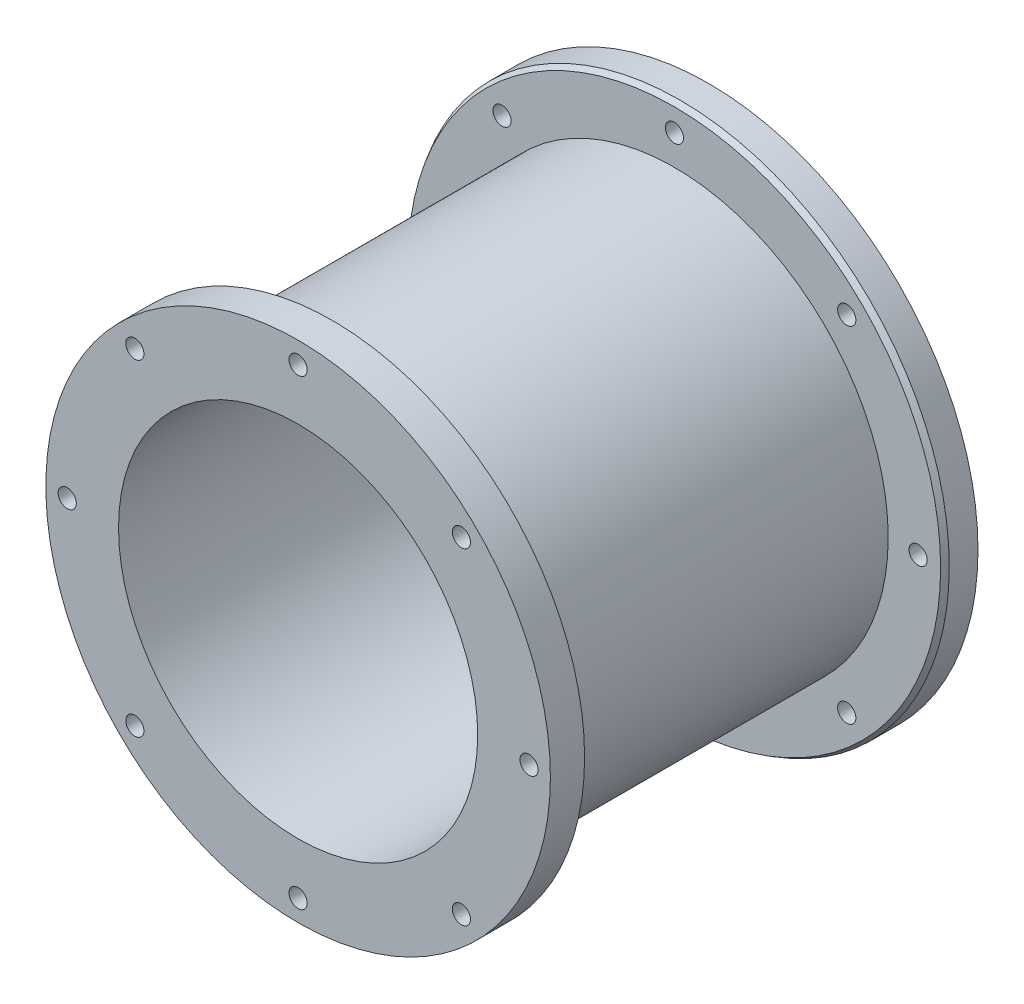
ISO-10303-21;
HEADER;
FILE_DESCRIPTION(('STEP AP214'),'2;1');
FILE_NAME('part.step','',(''),(''),'','','');
FILE_SCHEMA(('AUTOMOTIVE_DESIGN { 1 0 10303 214 1 1 1 1 }'));
ENDSEC;
DATA;
#1=APPLICATION_CONTEXT('core data for automotive mechanical design processes');
#2=APPLICATION_PROTOCOL_DEFINITION('international standard','automotive_design',2000,#1);
#3=PRODUCT_CONTEXT('',#1,'mechanical');
#4=PRODUCT('Part','Part','',(#3));
#5=PRODUCT_RELATED_PRODUCT_CATEGORY('part','',(#4));
#6=PRODUCT_DEFINITION_FORMATION('','',#4);
#7=PRODUCT_DEFINITION_CONTEXT('part definition',#1,'design');
#8=PRODUCT_DEFINITION('design','',#6,#7);
#9=PRODUCT_DEFINITION_SHAPE('','',#8);
#10=(LENGTH_UNIT() NAMED_UNIT(*) SI_UNIT(.MILLI.,.METRE.));
#11=(NAMED_UNIT(*) PLANE_ANGLE_UNIT() SI_UNIT($,.RADIAN.));
#12=(NAMED_UNIT(*) SI_UNIT($,.STERADIAN.) SOLID_ANGLE_UNIT());
#13=UNCERTAINTY_MEASURE_WITH_UNIT(LENGTH_MEASURE(1.E-05),#10,'distance_accuracy_value','');
#14=(GEOMETRIC_REPRESENTATION_CONTEXT(3) GLOBAL_UNCERTAINTY_ASSIGNED_CONTEXT((#13)) GLOBAL_UNIT_ASSIGNED_CONTEXT((#10,
#11,#12)) REPRESENTATION_CONTEXT('',''));
#15=CARTESIAN_POINT('',(0.,0.,0.));
#16=DIRECTION('',(0.,0.,1.));
#17=DIRECTION('',(1.,0.,0.));
#18=AXIS2_PLACEMENT_3D('',#15,#16,#17);
#19=CARTESIAN_POINT('',(0.,0.,0.));
#20=DIRECTION('',(0.,0.,1.));
#21=DIRECTION('',(1.,0.,0.));
#22=AXIS2_PLACEMENT_3D('',#19,#20,#21);
#23=PLANE('',#22);
#24=CARTESIAN_POINT('',(0.,0.,0.));
#25=DIRECTION('',(0.,0.,1.));
#26=DIRECTION('',(1.,0.,0.));
#27=AXIS2_PLACEMENT_3D('',#24,#25,#26);
#28=CIRCLE('',#27,74.2136250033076);
#29=CARTESIAN_POINT('',(74.2136250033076,0.,0.));
#30=VERTEX_POINT('',#29);
#31=EDGE_CURVE('E163',#30,#30,#28,.T.);
#32=ORIENTED_EDGE('',*,*,#31,.F.);
#33=EDGE_LOOP('',(#32));
#34=FACE_BOUND('',#33,.T.);
#35=CARTESIAN_POINT('',(0.,0.,0.));
#36=DIRECTION('',(0.,0.,1.));
#37=DIRECTION('',(1.,0.,0.));
#38=AXIS2_PLACEMENT_3D('',#35,#36,#37);
#39=CIRCLE('',#38,66.675);
#40=CARTESIAN_POINT('',(66.675,0.,0.));
#41=VERTEX_POINT('',#40);
#42=EDGE_CURVE('E44',#41,#41,#39,.T.);
#43=ORIENTED_EDGE('',*,*,#42,.T.);
#44=EDGE_LOOP('',(#43));
#45=FACE_BOUND('',#44,.T.);
#46=ADVANCED_FACE('F29',(#34,#45),#23,.F.);
#47=CARTESIAN_POINT('',(0.,0.,12.7));
#48=DIRECTION('',(0.,0.,1.));
#49=DIRECTION('',(1.,0.,0.));
#50=AXIS2_PLACEMENT_3D('',#47,#48,#49);
#51=PLANE('',#50);
#52=CARTESIAN_POINT('',(0.,0.,12.7));
#53=DIRECTION('',(0.,0.,1.));
#54=DIRECTION('',(1.,0.,0.));
#55=AXIS2_PLACEMENT_3D('',#52,#53,#54);
#56=CIRCLE('',#55,98.8393242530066);
#57=CARTESIAN_POINT('',(98.8393242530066,0.,12.7));
#58=VERTEX_POINT('',#57);
#59=EDGE_CURVE('E36',#58,#58,#56,.T.);
#60=ORIENTED_EDGE('',*,*,#59,.T.);
#61=EDGE_LOOP('',(#60));
#62=FACE_BOUND('',#61,.T.);
#63=CARTESIAN_POINT('',(-63.9843248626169,63.9843248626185,12.7));
#64=DIRECTION('',(0.,0.,1.));
#65=DIRECTION('',(1.,0.,0.));
#66=AXIS2_PLACEMENT_3D('',#63,#64,#65);
#67=CIRCLE('',#66,3.37819999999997);
#68=CARTESIAN_POINT('',(-60.606124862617,63.9843248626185,12.7));
#69=VERTEX_POINT('',#68);
#70=EDGE_CURVE('E80',#69,#69,#67,.T.);
#71=ORIENTED_EDGE('',*,*,#70,.F.);
#72=EDGE_LOOP('',(#71));
#73=FACE_BOUND('',#72,.T.);
#74=CARTESIAN_POINT('',(-90.4875,9.47806801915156E-13,12.7));
#75=DIRECTION('',(0.,0.,1.));
#76=DIRECTION('',(1.,0.,0.));
#77=AXIS2_PLACEMENT_3D('',#74,#75,#76);
#78=CIRCLE('',#77,3.37819999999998);
#79=CARTESIAN_POINT('',(-87.1093,9.47806801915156E-13,12.7));
#80=VERTEX_POINT('',#79);
#81=EDGE_CURVE('E85',#80,#80,#78,.T.);
#82=ORIENTED_EDGE('',*,*,#81,.F.);
#83=EDGE_LOOP('',(#82));
#84=FACE_BOUND('',#83,.T.);
#85=CARTESIAN_POINT('',(-63.9843248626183,-63.9843248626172,12.7));
#86=DIRECTION('',(0.,0.,1.));
#87=DIRECTION('',(1.,0.,0.));
#88=AXIS2_PLACEMENT_3D('',#85,#86,#87);
#89=CIRCLE('',#88,3.37819999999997);
#90=CARTESIAN_POINT('',(-60.6061248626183,-63.9843248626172,12.7));
#91=VERTEX_POINT('',#90);
#92=EDGE_CURVE('E89',#91,#91,#89,.T.);
#93=ORIENTED_EDGE('',*,*,#92,.F.);
#94=EDGE_LOOP('',(#93));
#95=FACE_BOUND('',#94,.T.);
#96=CARTESIAN_POINT('',(-6.3187120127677E-13,-90.4875,12.7));
#97=DIRECTION('',(0.,0.,1.));
#98=DIRECTION('',(1.,0.,0.));
#99=AXIS2_PLACEMENT_3D('',#96,#97,#98);
#100=CIRCLE('',#99,3.37819999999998);
#101=CARTESIAN_POINT('',(3.37819999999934,-90.4875,12.7));
#102=VERTEX_POINT('',#101);
#103=EDGE_CURVE('E93',#102,#102,#100,.T.);
#104=ORIENTED_EDGE('',*,*,#103,.F.);
#105=EDGE_LOOP('',(#104));
#106=FACE_BOUND('',#105,.T.);
#107=CARTESIAN_POINT('',(63.9843248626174,-63.9843248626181,12.7));
#108=DIRECTION('',(0.,0.,1.));
#109=DIRECTION('',(1.,0.,0.));
#110=AXIS2_PLACEMENT_3D('',#107,#108,#109);
#111=CIRCLE('',#110,3.37819999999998);
#112=CARTESIAN_POINT('',(67.3625248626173,-63.9843248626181,12.7));
#113=VERTEX_POINT('',#112);
#114=EDGE_CURVE('E97',#113,#113,#111,.T.);
#115=ORIENTED_EDGE('',*,*,#114,.F.);
#116=EDGE_LOOP('',(#115));
#117=FACE_BOUND('',#116,.T.);
#118=CARTESIAN_POINT('',(90.4875,-3.15935600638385E-13,12.7));
#119=DIRECTION('',(0.,0.,1.));
#120=DIRECTION('',(1.,0.,0.));
#121=AXIS2_PLACEMENT_3D('',#118,#119,#120);
#122=CIRCLE('',#121,3.37819999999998);
#123=CARTESIAN_POINT('',(93.8657,-3.15935600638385E-13,12.7));
#124=VERTEX_POINT('',#123);
#125=EDGE_CURVE('E101',#124,#124,#122,.T.);
#126=ORIENTED_EDGE('',*,*,#125,.F.);
#127=EDGE_LOOP('',(#126));
#128=FACE_BOUND('',#127,.T.);
#129=CARTESIAN_POINT('',(63.9843248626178,63.9843248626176,12.7));
#130=DIRECTION('',(0.,0.,1.));
#131=DIRECTION('',(1.,0.,0.));
#132=AXIS2_PLACEMENT_3D('',#129,#130,#131);
#133=CIRCLE('',#132,3.37819999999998);
#134=CARTESIAN_POINT('',(67.3625248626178,63.9843248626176,12.7));
#135=VERTEX_POINT('',#134);
#136=EDGE_CURVE('E105',#135,#135,#133,.T.);
#137=ORIENTED_EDGE('',*,*,#136,.F.);
#138=EDGE_LOOP('',(#137));
#139=FACE_BOUND('',#138,.T.);
#140=CARTESIAN_POINT('',(0.,90.4875,12.7));
#141=DIRECTION('',(0.,0.,1.));
#142=DIRECTION('',(1.,0.,0.));
#143=AXIS2_PLACEMENT_3D('',#140,#141,#142);
#144=CIRCLE('',#143,3.37819999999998);
#145=CARTESIAN_POINT('',(3.37819999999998,90.4875,12.7));
#146=VERTEX_POINT('',#145);
#147=EDGE_CURVE('E109',#146,#146,#144,.T.);
#148=ORIENTED_EDGE('',*,*,#147,.F.);
#149=EDGE_LOOP('',(#148));
#150=FACE_BOUND('',#149,.T.);
#151=CARTESIAN_POINT('',(0.,0.,12.7));
#152=DIRECTION('',(0.,0.,1.));
#153=DIRECTION('',(1.,0.,0.));
#154=AXIS2_PLACEMENT_3D('',#151,#152,#153);
#155=CIRCLE('',#154,79.375);
#156=CARTESIAN_POINT('',(79.375,0.,12.7));
#157=VERTEX_POINT('',#156);
#158=EDGE_CURVE('E111',#157,#157,#155,.T.);
#159=ORIENTED_EDGE('',*,*,#158,.F.);
#160=EDGE_LOOP('',(#159));
#161=FACE_BOUND('',#160,.T.);
#162=ADVANCED_FACE('F197',(#62,#73,#84,#95,#106,#117,#128,#139,#150,#161),#51,.T.);
#163=CARTESIAN_POINT('',(0.,0.,0.));
#164=DIRECTION('',(0.,0.,1.));
#165=DIRECTION('',(1.,0.,0.));
#166=AXIS2_PLACEMENT_3D('',#163,#164,#165);
#167=CIRCLE('',#166,79.2276420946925);
#168=CARTESIAN_POINT('',(79.2276420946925,0.,0.));
#169=VERTEX_POINT('',#168);
#170=EDGE_CURVE('E166',#169,#169,#167,.T.);
#171=ORIENTED_EDGE('',*,*,#170,.T.);
#172=EDGE_LOOP('',(#171));
#173=FACE_BOUND('',#172,.T.);
#174=CARTESIAN_POINT('',(-63.9843248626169,63.9843248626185,0.));
#175=DIRECTION('',(0.,0.,-1.));
#176=DIRECTION('',(-1.,0.,0.));
#177=AXIS2_PLACEMENT_3D('',#174,#175,#176);
#178=CIRCLE('',#177,3.37819999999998);
#179=CARTESIAN_POINT('',(-67.3625248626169,63.9843248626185,0.));
#180=VERTEX_POINT('',#179);
#181=EDGE_CURVE('E84',#180,#180,#178,.T.);
#182=ORIENTED_EDGE('',*,*,#181,.F.);
#183=EDGE_LOOP('',(#182));
#184=FACE_BOUND('',#183,.T.);
#185=CARTESIAN_POINT('',(-90.4875,9.47806801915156E-13,0.));
#186=DIRECTION('',(0.,0.,-1.));
#187=DIRECTION('',(-1.,0.,0.));
#188=AXIS2_PLACEMENT_3D('',#185,#186,#187);
#189=CIRCLE('',#188,3.37819999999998);
#190=CARTESIAN_POINT('',(-93.8657,9.47806801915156E-13,0.));
#191=VERTEX_POINT('',#190);
#192=EDGE_CURVE('E83',#191,#191,#189,.T.);
#193=ORIENTED_EDGE('',*,*,#192,.F.);
#194=EDGE_LOOP('',(#193));
#195=FACE_BOUND('',#194,.T.);
#196=CARTESIAN_POINT('',(-63.9843248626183,-63.9843248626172,0.));
#197=DIRECTION('',(0.,0.,-1.));
#198=DIRECTION('',(-1.,0.,0.));
#199=AXIS2_PLACEMENT_3D('',#196,#197,#198);
#200=CIRCLE('',#199,3.37819999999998);
#201=CARTESIAN_POINT('',(-67.3625248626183,-63.9843248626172,0.));
#202=VERTEX_POINT('',#201);
#203=EDGE_CURVE('E88',#202,#202,#200,.T.);
#204=ORIENTED_EDGE('',*,*,#203,.F.);
#205=EDGE_LOOP('',(#204));
#206=FACE_BOUND('',#205,.T.);
#207=CARTESIAN_POINT('',(-6.3187120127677E-13,-90.4875,0.));
#208=DIRECTION('',(0.,0.,-1.));
#209=DIRECTION('',(-1.,0.,0.));
#210=AXIS2_PLACEMENT_3D('',#207,#208,#209);
#211=CIRCLE('',#210,3.37819999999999);
#212=CARTESIAN_POINT('',(-3.37820000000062,-90.4875,0.));
#213=VERTEX_POINT('',#212);
#214=EDGE_CURVE('E92',#213,#213,#211,.T.);
#215=ORIENTED_EDGE('',*,*,#214,.F.);
#216=EDGE_LOOP('',(#215));
#217=FACE_BOUND('',#216,.T.);
#218=CARTESIAN_POINT('',(63.9843248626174,-63.9843248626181,0.));
#219=DIRECTION('',(0.,0.,-1.));
#220=DIRECTION('',(-1.,0.,0.));
#221=AXIS2_PLACEMENT_3D('',#218,#219,#220);
#222=CIRCLE('',#221,3.37819999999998);
#223=CARTESIAN_POINT('',(60.6061248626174,-63.9843248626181,0.));
#224=VERTEX_POINT('',#223);
#225=EDGE_CURVE('E96',#224,#224,#222,.T.);
#226=ORIENTED_EDGE('',*,*,#225,.F.);
#227=EDGE_LOOP('',(#226));
#228=FACE_BOUND('',#227,.T.);
#229=CARTESIAN_POINT('',(90.4875,-3.15935600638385E-13,0.));
#230=DIRECTION('',(0.,0.,-1.));
#231=DIRECTION('',(-1.,0.,0.));
#232=AXIS2_PLACEMENT_3D('',#229,#230,#231);
#233=CIRCLE('',#232,3.37819999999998);
#234=CARTESIAN_POINT('',(87.1093,-3.15935600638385E-13,0.));
#235=VERTEX_POINT('',#234);
#236=EDGE_CURVE('E100',#235,#235,#233,.T.);
#237=ORIENTED_EDGE('',*,*,#236,.F.);
#238=EDGE_LOOP('',(#237));
#239=FACE_BOUND('',#238,.T.);
#240=CARTESIAN_POINT('',(63.9843248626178,63.9843248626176,0.));
#241=DIRECTION('',(0.,0.,-1.));
#242=DIRECTION('',(-1.,0.,0.));
#243=AXIS2_PLACEMENT_3D('',#240,#241,#242);
#244=CIRCLE('',#243,3.37819999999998);
#245=CARTESIAN_POINT('',(60.6061248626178,63.9843248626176,0.));
#246=VERTEX_POINT('',#245);
#247=EDGE_CURVE('E104',#246,#246,#244,.T.);
#248=ORIENTED_EDGE('',*,*,#247,.F.);
#249=EDGE_LOOP('',(#248));
#250=FACE_BOUND('',#249,.T.);
#251=CARTESIAN_POINT('',(0.,90.4875,0.));
#252=DIRECTION('',(0.,0.,-1.));
#253=DIRECTION('',(-1.,0.,0.));
#254=AXIS2_PLACEMENT_3D('',#251,#252,#253);
#255=CIRCLE('',#254,3.37819999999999);
#256=CARTESIAN_POINT('',(-3.37819999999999,90.4875,0.));
#257=VERTEX_POINT('',#256);
#258=EDGE_CURVE('E108',#257,#257,#255,.T.);
#259=ORIENTED_EDGE('',*,*,#258,.F.);
#260=EDGE_LOOP('',(#259));
#261=FACE_BOUND('',#260,.T.);
#262=CARTESIAN_POINT('',(0.,0.,0.));
#263=DIRECTION('',(0.,0.,1.));
#264=DIRECTION('',(1.,0.,0.));
#265=AXIS2_PLACEMENT_3D('',#262,#263,#264);
#266=CIRCLE('',#265,100.0125);
#267=CARTESIAN_POINT('',(100.0125,0.,0.));
#268=VERTEX_POINT('',#267);
#269=EDGE_CURVE('E40',#268,#268,#266,.T.);
#270=ORIENTED_EDGE('',*,*,#269,.F.);
#271=EDGE_LOOP('',(#270));
#272=FACE_BOUND('',#271,.T.);
#273=ADVANCED_FACE('F199',(#173,#184,#195,#206,#217,#228,#239,#250,#261,#272),#23,.F.);
#274=CARTESIAN_POINT('',(0.,0.,12.7));
#275=DIRECTION('',(0.,0.,-1.));
#276=DIRECTION('',(-1.,0.,0.));
#277=AXIS2_PLACEMENT_3D('',#274,#275,#276);
#278=CYLINDRICAL_SURFACE('',#277,100.0125);
#279=CARTESIAN_POINT('',(0.,0.,10.668));
#280=DIRECTION('',(0.,0.,1.));
#281=DIRECTION('',(1.,0.,0.));
#282=AXIS2_PLACEMENT_3D('',#279,#280,#281);
#283=CIRCLE('',#282,100.0125);
#284=CARTESIAN_POINT('',(100.0125,0.,10.668));
#285=VERTEX_POINT('',#284);
#286=EDGE_CURVE('E10',#285,#285,#283,.F.);
#287=ORIENTED_EDGE('',*,*,#286,.T.);
#288=EDGE_LOOP('',(#287));
#289=FACE_BOUND('',#288,.T.);
#290=ORIENTED_EDGE('',*,*,#269,.T.);
#291=EDGE_LOOP('',(#290));
#292=FACE_BOUND('',#291,.T.);
#293=ADVANCED_FACE('F31',(#289,#292),#278,.T.);
#294=CARTESIAN_POINT('',(0.,0.,12.7));
#295=DIRECTION('',(0.,0.,-1.));
#296=DIRECTION('',(-1.,0.,0.));
#297=AXIS2_PLACEMENT_3D('',#294,#295,#296);
#298=CYLINDRICAL_SURFACE('',#297,66.675);
#299=ORIENTED_EDGE('',*,*,#42,.F.);
#300=EDGE_LOOP('',(#299));
#301=FACE_BOUND('',#300,.T.);
#302=CARTESIAN_POINT('',(0.,0.,152.4));
#303=DIRECTION('',(0.,0.,1.));
#304=DIRECTION('',(1.,0.,0.));
#305=AXIS2_PLACEMENT_3D('',#302,#303,#304);
#306=CIRCLE('',#305,66.675);
#307=CARTESIAN_POINT('',(66.675,0.,152.4));
#308=VERTEX_POINT('',#307);
#309=EDGE_CURVE('E79',#308,#308,#306,.T.);
#310=ORIENTED_EDGE('',*,*,#309,.T.);
#311=EDGE_LOOP('',(#310));
#312=FACE_BOUND('',#311,.T.);
#313=ADVANCED_FACE('F202',(#301,#312),#298,.F.);
#314=CARTESIAN_POINT('',(0.,0.,139.7));
#315=DIRECTION('',(0.,0.,-1.));
#316=DIRECTION('',(-1.,0.,0.));
#317=AXIS2_PLACEMENT_3D('',#314,#315,#316);
#318=CYLINDRICAL_SURFACE('',#317,79.375);
#319=CARTESIAN_POINT('',(0.,0.,139.7));
#320=DIRECTION('',(0.,0.,1.));
#321=DIRECTION('',(1.,0.,0.));
#322=AXIS2_PLACEMENT_3D('',#319,#320,#321);
#323=CIRCLE('',#322,79.375);
#324=CARTESIAN_POINT('',(79.375,0.,139.7));
#325=VERTEX_POINT('',#324);
#326=EDGE_CURVE('E115',#325,#325,#323,.T.);
#327=ORIENTED_EDGE('',*,*,#326,.F.);
#328=EDGE_LOOP('',(#327));
#329=FACE_BOUND('',#328,.T.);
#330=ORIENTED_EDGE('',*,*,#158,.T.);
#331=EDGE_LOOP('',(#330));
#332=FACE_BOUND('',#331,.T.);
#333=ADVANCED_FACE('F205',(#329,#332),#318,.T.);
#334=CARTESIAN_POINT('',(0.,90.4875,0.));
#335=DIRECTION('',(0.,0.,-1.));
#336=DIRECTION('',(-1.,0.,0.));
#337=AXIS2_PLACEMENT_3D('',#334,#335,#336);
#338=CYLINDRICAL_SURFACE('',#337,3.37819999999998);
#339=ORIENTED_EDGE('',*,*,#147,.T.);
#340=EDGE_LOOP('',(#339));
#341=FACE_BOUND('',#340,.T.);
#342=ORIENTED_EDGE('',*,*,#258,.T.);
#343=EDGE_LOOP('',(#342));
#344=FACE_BOUND('',#343,.T.);
#345=ADVANCED_FACE('F255',(#341,#344),#338,.F.);
#346=CARTESIAN_POINT('',(63.9843248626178,63.9843248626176,0.));
#347=DIRECTION('',(0.,0.,-1.));
#348=DIRECTION('',(-1.,0.,0.));
#349=AXIS2_PLACEMENT_3D('',#346,#347,#348);
#350=CYLINDRICAL_SURFACE('',#349,3.37819999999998);
#351=ORIENTED_EDGE('',*,*,#136,.T.);
#352=EDGE_LOOP('',(#351));
#353=FACE_BOUND('',#352,.T.);
#354=ORIENTED_EDGE('',*,*,#247,.T.);
#355=EDGE_LOOP('',(#354));
#356=FACE_BOUND('',#355,.T.);
#357=ADVANCED_FACE('F251',(#353,#356),#350,.F.);
#358=CARTESIAN_POINT('',(90.4875,-3.15935600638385E-13,0.));
#359=DIRECTION('',(0.,0.,-1.));
#360=DIRECTION('',(-1.,0.,0.));
#361=AXIS2_PLACEMENT_3D('',#358,#359,#360);
#362=CYLINDRICAL_SURFACE('',#361,3.37819999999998);
#363=ORIENTED_EDGE('',*,*,#125,.T.);
#364=EDGE_LOOP('',(#363));
#365=FACE_BOUND('',#364,.T.);
#366=ORIENTED_EDGE('',*,*,#236,.T.);
#367=EDGE_LOOP('',(#366));
#368=FACE_BOUND('',#367,.T.);
#369=ADVANCED_FACE('F247',(#365,#368),#362,.F.);
#370=CARTESIAN_POINT('',(63.9843248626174,-63.9843248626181,0.));
#371=DIRECTION('',(0.,0.,-1.));
#372=DIRECTION('',(-1.,0.,0.));
#373=AXIS2_PLACEMENT_3D('',#370,#371,#372);
#374=CYLINDRICAL_SURFACE('',#373,3.37819999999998);
#375=ORIENTED_EDGE('',*,*,#114,.T.);
#376=EDGE_LOOP('',(#375));
#377=FACE_BOUND('',#376,.T.);
#378=ORIENTED_EDGE('',*,*,#225,.T.);
#379=EDGE_LOOP('',(#378));
#380=FACE_BOUND('',#379,.T.);
#381=ADVANCED_FACE('F243',(#377,#380),#374,.F.);
#382=CARTESIAN_POINT('',(-6.3187120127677E-13,-90.4875,0.));
#383=DIRECTION('',(0.,0.,-1.));
#384=DIRECTION('',(-1.,0.,0.));
#385=AXIS2_PLACEMENT_3D('',#382,#383,#384);
#386=CYLINDRICAL_SURFACE('',#385,3.37819999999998);
#387=ORIENTED_EDGE('',*,*,#103,.T.);
#388=EDGE_LOOP('',(#387));
#389=FACE_BOUND('',#388,.T.);
#390=ORIENTED_EDGE('',*,*,#214,.T.);
#391=EDGE_LOOP('',(#390));
#392=FACE_BOUND('',#391,.T.);
#393=ADVANCED_FACE('F239',(#389,#392),#386,.F.);
#394=CARTESIAN_POINT('',(-63.9843248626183,-63.9843248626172,0.));
#395=DIRECTION('',(0.,0.,-1.));
#396=DIRECTION('',(-1.,0.,0.));
#397=AXIS2_PLACEMENT_3D('',#394,#395,#396);
#398=CYLINDRICAL_SURFACE('',#397,3.37819999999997);
#399=ORIENTED_EDGE('',*,*,#92,.T.);
#400=EDGE_LOOP('',(#399));
#401=FACE_BOUND('',#400,.T.);
#402=ORIENTED_EDGE('',*,*,#203,.T.);
#403=EDGE_LOOP('',(#402));
#404=FACE_BOUND('',#403,.T.);
#405=ADVANCED_FACE('F235',(#401,#404),#398,.F.);
#406=CARTESIAN_POINT('',(-90.4875,9.47806801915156E-13,0.));
#407=DIRECTION('',(0.,0.,-1.));
#408=DIRECTION('',(-1.,0.,0.));
#409=AXIS2_PLACEMENT_3D('',#406,#407,#408);
#410=CYLINDRICAL_SURFACE('',#409,3.37819999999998);
#411=ORIENTED_EDGE('',*,*,#81,.T.);
#412=EDGE_LOOP('',(#411));
#413=FACE_BOUND('',#412,.T.);
#414=ORIENTED_EDGE('',*,*,#192,.T.);
#415=EDGE_LOOP('',(#414));
#416=FACE_BOUND('',#415,.T.);
#417=ADVANCED_FACE('F231',(#413,#416),#410,.F.);
#418=CARTESIAN_POINT('',(-63.9843248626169,63.9843248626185,0.));
#419=DIRECTION('',(0.,0.,-1.));
#420=DIRECTION('',(-1.,0.,0.));
#421=AXIS2_PLACEMENT_3D('',#418,#419,#420);
#422=CYLINDRICAL_SURFACE('',#421,3.37819999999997);
#423=ORIENTED_EDGE('',*,*,#70,.T.);
#424=EDGE_LOOP('',(#423));
#425=FACE_BOUND('',#424,.T.);
#426=ORIENTED_EDGE('',*,*,#181,.T.);
#427=EDGE_LOOP('',(#426));
#428=FACE_BOUND('',#427,.T.);
#429=ADVANCED_FACE('F222',(#425,#428),#422,.F.);
#430=CARTESIAN_POINT('',(0.,0.,139.7));
#431=DIRECTION('',(0.,0.,1.));
#432=DIRECTION('',(1.,0.,0.));
#433=AXIS2_PLACEMENT_3D('',#430,#431,#432);
#434=PLANE('',#433);
#435=CARTESIAN_POINT('',(-60.616728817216,60.6167288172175,139.7));
#436=DIRECTION('',(0.,0.,1.));
#437=DIRECTION('',(1.,0.,0.));
#438=AXIS2_PLACEMENT_3D('',#435,#436,#437);
#439=CIRCLE('',#438,3.37819999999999);
#440=CARTESIAN_POINT('',(-57.2385288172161,60.6167288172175,139.7));
#441=VERTEX_POINT('',#440);
#442=EDGE_CURVE('E47',#441,#441,#439,.T.);
#443=ORIENTED_EDGE('',*,*,#442,.T.);
#444=EDGE_LOOP('',(#443));
#445=FACE_BOUND('',#444,.T.);
#446=CARTESIAN_POINT('',(-85.725,8.97922233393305E-13,139.7));
#447=DIRECTION('',(0.,0.,1.));
#448=DIRECTION('',(1.,0.,0.));
#449=AXIS2_PLACEMENT_3D('',#446,#447,#448);
#450=CIRCLE('',#449,3.37819999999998);
#451=CARTESIAN_POINT('',(-82.3468,8.97922233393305E-13,139.7));
#452=VERTEX_POINT('',#451);
#453=EDGE_CURVE('E52',#452,#452,#450,.T.);
#454=ORIENTED_EDGE('',*,*,#453,.T.);
#455=EDGE_LOOP('',(#454));
#456=FACE_BOUND('',#455,.T.);
#457=CARTESIAN_POINT('',(-60.6167288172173,-60.6167288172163,139.7));
#458=DIRECTION('',(0.,0.,1.));
#459=DIRECTION('',(1.,0.,0.));
#460=AXIS2_PLACEMENT_3D('',#457,#458,#459);
#461=CIRCLE('',#460,3.37819999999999);
#462=CARTESIAN_POINT('',(-57.2385288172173,-60.6167288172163,139.7));
#463=VERTEX_POINT('',#462);
#464=EDGE_CURVE('E56',#463,#463,#461,.T.);
#465=ORIENTED_EDGE('',*,*,#464,.T.);
#466=EDGE_LOOP('',(#465));
#467=FACE_BOUND('',#466,.T.);
#468=CARTESIAN_POINT('',(-5.98614822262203E-13,-85.725,139.7));
#469=DIRECTION('',(0.,0.,1.));
#470=DIRECTION('',(1.,0.,0.));
#471=AXIS2_PLACEMENT_3D('',#468,#469,#470);
#472=CIRCLE('',#471,3.37819999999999);
#473=CARTESIAN_POINT('',(3.37819999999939,-85.725,139.7));
#474=VERTEX_POINT('',#473);
#475=EDGE_CURVE('E60',#474,#474,#472,.T.);
#476=ORIENTED_EDGE('',*,*,#475,.T.);
#477=EDGE_LOOP('',(#476));
#478=FACE_BOUND('',#477,.T.);
#479=CARTESIAN_POINT('',(60.6167288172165,-60.6167288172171,139.7));
#480=DIRECTION('',(0.,0.,1.));
#481=DIRECTION('',(1.,0.,0.));
#482=AXIS2_PLACEMENT_3D('',#479,#480,#481);
#483=CIRCLE('',#482,3.37819999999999);
#484=CARTESIAN_POINT('',(63.9949288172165,-60.6167288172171,139.7));
#485=VERTEX_POINT('',#484);
#486=EDGE_CURVE('E64',#485,#485,#483,.T.);
#487=ORIENTED_EDGE('',*,*,#486,.T.);
#488=EDGE_LOOP('',(#487));
#489=FACE_BOUND('',#488,.T.);
#490=CARTESIAN_POINT('',(85.725,-2.99307411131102E-13,139.7));
#491=DIRECTION('',(0.,0.,1.));
#492=DIRECTION('',(1.,0.,0.));
#493=AXIS2_PLACEMENT_3D('',#490,#491,#492);
#494=CIRCLE('',#493,3.37819999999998);
#495=CARTESIAN_POINT('',(89.1032,-2.99307411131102E-13,139.7));
#496=VERTEX_POINT('',#495);
#497=EDGE_CURVE('E68',#496,#496,#494,.T.);
#498=ORIENTED_EDGE('',*,*,#497,.T.);
#499=EDGE_LOOP('',(#498));
#500=FACE_BOUND('',#499,.T.);
#501=CARTESIAN_POINT('',(60.6167288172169,60.6167288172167,139.7));
#502=DIRECTION('',(0.,0.,1.));
#503=DIRECTION('',(1.,0.,0.));
#504=AXIS2_PLACEMENT_3D('',#501,#502,#503);
#505=CIRCLE('',#504,3.37819999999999);
#506=CARTESIAN_POINT('',(63.9949288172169,60.6167288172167,139.7));
#507=VERTEX_POINT('',#506);
#508=EDGE_CURVE('E72',#507,#507,#505,.T.);
#509=ORIENTED_EDGE('',*,*,#508,.T.);
#510=EDGE_LOOP('',(#509));
#511=FACE_BOUND('',#510,.T.);
#512=CARTESIAN_POINT('',(0.,85.725,139.7));
#513=DIRECTION('',(0.,0.,1.));
#514=DIRECTION('',(1.,0.,0.));
#515=AXIS2_PLACEMENT_3D('',#512,#513,#514);
#516=CIRCLE('',#515,3.37819999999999);
#517=CARTESIAN_POINT('',(3.37819999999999,85.725,139.7));
#518=VERTEX_POINT('',#517);
#519=EDGE_CURVE('E76',#518,#518,#516,.T.);
#520=ORIENTED_EDGE('',*,*,#519,.T.);
#521=EDGE_LOOP('',(#520));
#522=FACE_BOUND('',#521,.T.);
#523=CARTESIAN_POINT('',(0.,0.,139.7));
#524=DIRECTION('',(0.,0.,1.));
#525=DIRECTION('',(1.,0.,0.));
#526=AXIS2_PLACEMENT_3D('',#523,#524,#525);
#527=CIRCLE('',#526,93.6625);
#528=CARTESIAN_POINT('',(93.6625,0.,139.7));
#529=VERTEX_POINT('',#528);
#530=EDGE_CURVE('E139',#529,#529,#527,.T.);
#531=ORIENTED_EDGE('',*,*,#530,.F.);
#532=EDGE_LOOP('',(#531));
#533=FACE_BOUND('',#532,.T.);
#534=ORIENTED_EDGE('',*,*,#326,.T.);
#535=EDGE_LOOP('',(#534));
#536=FACE_BOUND('',#535,.T.);
#537=ADVANCED_FACE('F212',(#445,#456,#467,#478,#489,#500,#511,#522,#533,#536),#434,.F.);
#538=CARTESIAN_POINT('',(0.,0.,152.4));
#539=DIRECTION('',(0.,0.,1.));
#540=DIRECTION('',(1.,0.,0.));
#541=AXIS2_PLACEMENT_3D('',#538,#539,#540);
#542=PLANE('',#541);
#543=CARTESIAN_POINT('',(-60.616728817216,60.6167288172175,152.4));
#544=DIRECTION('',(0.,0.,1.));
#545=DIRECTION('',(1.,0.,0.));
#546=AXIS2_PLACEMENT_3D('',#543,#544,#545);
#547=CIRCLE('',#546,3.37819999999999);
#548=CARTESIAN_POINT('',(-57.2385288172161,60.6167288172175,152.4));
#549=VERTEX_POINT('',#548);
#550=EDGE_CURVE('E51',#549,#549,#547,.T.);
#551=ORIENTED_EDGE('',*,*,#550,.F.);
#552=EDGE_LOOP('',(#551));
#553=FACE_BOUND('',#552,.T.);
#554=CARTESIAN_POINT('',(-85.725,8.97922233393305E-13,152.4));
#555=DIRECTION('',(0.,0.,1.));
#556=DIRECTION('',(1.,0.,0.));
#557=AXIS2_PLACEMENT_3D('',#554,#555,#556);
#558=CIRCLE('',#557,3.37819999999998);
#559=CARTESIAN_POINT('',(-82.3468,8.97922233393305E-13,152.4));
#560=VERTEX_POINT('',#559);
#561=EDGE_CURVE('E50',#560,#560,#558,.T.);
#562=ORIENTED_EDGE('',*,*,#561,.F.);
#563=EDGE_LOOP('',(#562));
#564=FACE_BOUND('',#563,.T.);
#565=CARTESIAN_POINT('',(-60.6167288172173,-60.6167288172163,152.4));
#566=DIRECTION('',(0.,0.,1.));
#567=DIRECTION('',(1.,0.,0.));
#568=AXIS2_PLACEMENT_3D('',#565,#566,#567);
#569=CIRCLE('',#568,3.37819999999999);
#570=CARTESIAN_POINT('',(-57.2385288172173,-60.6167288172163,152.4));
#571=VERTEX_POINT('',#570);
#572=EDGE_CURVE('E55',#571,#571,#569,.T.);
#573=ORIENTED_EDGE('',*,*,#572,.F.);
#574=EDGE_LOOP('',(#573));
#575=FACE_BOUND('',#574,.T.);
#576=CARTESIAN_POINT('',(-5.98614822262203E-13,-85.725,152.4));
#577=DIRECTION('',(0.,0.,1.));
#578=DIRECTION('',(1.,0.,0.));
#579=AXIS2_PLACEMENT_3D('',#576,#577,#578);
#580=CIRCLE('',#579,3.37819999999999);
#581=CARTESIAN_POINT('',(3.37819999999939,-85.725,152.4));
#582=VERTEX_POINT('',#581);
#583=EDGE_CURVE('E59',#582,#582,#580,.T.);
#584=ORIENTED_EDGE('',*,*,#583,.F.);
#585=EDGE_LOOP('',(#584));
#586=FACE_BOUND('',#585,.T.);
#587=CARTESIAN_POINT('',(60.6167288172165,-60.6167288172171,152.4));
#588=DIRECTION('',(0.,0.,1.));
#589=DIRECTION('',(1.,0.,0.));
#590=AXIS2_PLACEMENT_3D('',#587,#588,#589);
#591=CIRCLE('',#590,3.37819999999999);
#592=CARTESIAN_POINT('',(63.9949288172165,-60.6167288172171,152.4));
#593=VERTEX_POINT('',#592);
#594=EDGE_CURVE('E63',#593,#593,#591,.T.);
#595=ORIENTED_EDGE('',*,*,#594,.F.);
#596=EDGE_LOOP('',(#595));
#597=FACE_BOUND('',#596,.T.);
#598=CARTESIAN_POINT('',(85.725,-2.99307411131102E-13,152.4));
#599=DIRECTION('',(0.,0.,1.));
#600=DIRECTION('',(1.,0.,0.));
#601=AXIS2_PLACEMENT_3D('',#598,#599,#600);
#602=CIRCLE('',#601,3.37819999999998);
#603=CARTESIAN_POINT('',(89.1032,-2.99307411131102E-13,152.4));
#604=VERTEX_POINT('',#603);
#605=EDGE_CURVE('E67',#604,#604,#602,.T.);
#606=ORIENTED_EDGE('',*,*,#605,.F.);
#607=EDGE_LOOP('',(#606));
#608=FACE_BOUND('',#607,.T.);
#609=CARTESIAN_POINT('',(60.6167288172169,60.6167288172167,152.4));
#610=DIRECTION('',(0.,0.,1.));
#611=DIRECTION('',(1.,0.,0.));
#612=AXIS2_PLACEMENT_3D('',#609,#610,#611);
#613=CIRCLE('',#612,3.37819999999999);
#614=CARTESIAN_POINT('',(63.9949288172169,60.6167288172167,152.4));
#615=VERTEX_POINT('',#614);
#616=EDGE_CURVE('E71',#615,#615,#613,.T.);
#617=ORIENTED_EDGE('',*,*,#616,.F.);
#618=EDGE_LOOP('',(#617));
#619=FACE_BOUND('',#618,.T.);
#620=CARTESIAN_POINT('',(0.,85.725,152.4));
#621=DIRECTION('',(0.,0.,1.));
#622=DIRECTION('',(1.,0.,0.));
#623=AXIS2_PLACEMENT_3D('',#620,#621,#622);
#624=CIRCLE('',#623,3.37819999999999);
#625=CARTESIAN_POINT('',(3.37819999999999,85.725,152.4));
#626=VERTEX_POINT('',#625);
#627=EDGE_CURVE('E75',#626,#626,#624,.T.);
#628=ORIENTED_EDGE('',*,*,#627,.F.);
#629=EDGE_LOOP('',(#628));
#630=FACE_BOUND('',#629,.T.);
#631=CARTESIAN_POINT('',(0.,0.,152.4));
#632=DIRECTION('',(0.,0.,1.));
#633=DIRECTION('',(1.,0.,0.));
#634=AXIS2_PLACEMENT_3D('',#631,#632,#633);
#635=CIRCLE('',#634,93.6625);
#636=CARTESIAN_POINT('',(93.6625,0.,152.4));
#637=VERTEX_POINT('',#636);
#638=EDGE_CURVE('E136',#637,#637,#635,.T.);
#639=ORIENTED_EDGE('',*,*,#638,.T.);
#640=EDGE_LOOP('',(#639));
#641=FACE_BOUND('',#640,.T.);
#642=ORIENTED_EDGE('',*,*,#309,.F.);
#643=EDGE_LOOP('',(#642));
#644=FACE_BOUND('',#643,.T.);
#645=ADVANCED_FACE('F209',(#553,#564,#575,#586,#597,#608,#619,#630,#641,#644),#542,.T.);
#646=CARTESIAN_POINT('',(0.,0.,152.4));
#647=DIRECTION('',(0.,0.,-1.));
#648=DIRECTION('',(-1.,0.,0.));
#649=AXIS2_PLACEMENT_3D('',#646,#647,#648);
#650=CYLINDRICAL_SURFACE('',#649,93.6625);
#651=ORIENTED_EDGE('',*,*,#638,.F.);
#652=EDGE_LOOP('',(#651));
#653=FACE_BOUND('',#652,.T.);
#654=ORIENTED_EDGE('',*,*,#530,.T.);
#655=EDGE_LOOP('',(#654));
#656=FACE_BOUND('',#655,.T.);
#657=ADVANCED_FACE('F211',(#653,#656),#650,.T.);
#658=CARTESIAN_POINT('',(0.,85.725,152.4));
#659=DIRECTION('',(0.,0.,1.));
#660=DIRECTION('',(1.,0.,0.));
#661=AXIS2_PLACEMENT_3D('',#658,#659,#660);
#662=CYLINDRICAL_SURFACE('',#661,3.37819999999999);
#663=ORIENTED_EDGE('',*,*,#627,.T.);
#664=EDGE_LOOP('',(#663));
#665=FACE_BOUND('',#664,.T.);
#666=ORIENTED_EDGE('',*,*,#519,.F.);
#667=EDGE_LOOP('',(#666));
#668=FACE_BOUND('',#667,.T.);
#669=ADVANCED_FACE('F219',(#665,#668),#662,.F.);
#670=CARTESIAN_POINT('',(60.6167288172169,60.6167288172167,152.4));
#671=DIRECTION('',(0.,0.,1.));
#672=DIRECTION('',(1.,0.,0.));
#673=AXIS2_PLACEMENT_3D('',#670,#671,#672);
#674=CYLINDRICAL_SURFACE('',#673,3.37819999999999);
#675=ORIENTED_EDGE('',*,*,#616,.T.);
#676=EDGE_LOOP('',(#675));
#677=FACE_BOUND('',#676,.T.);
#678=ORIENTED_EDGE('',*,*,#508,.F.);
#679=EDGE_LOOP('',(#678));
#680=FACE_BOUND('',#679,.T.);
#681=ADVANCED_FACE('F360',(#677,#680),#674,.F.);
#682=CARTESIAN_POINT('',(85.725,-2.99307411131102E-13,152.4));
#683=DIRECTION('',(0.,0.,1.));
#684=DIRECTION('',(1.,0.,0.));
#685=AXIS2_PLACEMENT_3D('',#682,#683,#684);
#686=CYLINDRICAL_SURFACE('',#685,3.37819999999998);
#687=ORIENTED_EDGE('',*,*,#605,.T.);
#688=EDGE_LOOP('',(#687));
#689=FACE_BOUND('',#688,.T.);
#690=ORIENTED_EDGE('',*,*,#497,.F.);
#691=EDGE_LOOP('',(#690));
#692=FACE_BOUND('',#691,.T.);
#693=ADVANCED_FACE('F369',(#689,#692),#686,.F.);
#694=CARTESIAN_POINT('',(60.6167288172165,-60.6167288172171,152.4));
#695=DIRECTION('',(0.,0.,1.));
#696=DIRECTION('',(1.,0.,0.));
#697=AXIS2_PLACEMENT_3D('',#694,#695,#696);
#698=CYLINDRICAL_SURFACE('',#697,3.37819999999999);
#699=ORIENTED_EDGE('',*,*,#594,.T.);
#700=EDGE_LOOP('',(#699));
#701=FACE_BOUND('',#700,.T.);
#702=ORIENTED_EDGE('',*,*,#486,.F.);
#703=EDGE_LOOP('',(#702));
#704=FACE_BOUND('',#703,.T.);
#705=ADVANCED_FACE('F379',(#701,#704),#698,.F.);
#706=CARTESIAN_POINT('',(-5.98614822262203E-13,-85.725,152.4));
#707=DIRECTION('',(0.,0.,1.));
#708=DIRECTION('',(1.,0.,0.));
#709=AXIS2_PLACEMENT_3D('',#706,#707,#708);
#710=CYLINDRICAL_SURFACE('',#709,3.37819999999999);
#711=ORIENTED_EDGE('',*,*,#583,.T.);
#712=EDGE_LOOP('',(#711));
#713=FACE_BOUND('',#712,.T.);
#714=ORIENTED_EDGE('',*,*,#475,.F.);
#715=EDGE_LOOP('',(#714));
#716=FACE_BOUND('',#715,.T.);
#717=ADVANCED_FACE('F389',(#713,#716),#710,.F.);
#718=CARTESIAN_POINT('',(-60.6167288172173,-60.6167288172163,152.4));
#719=DIRECTION('',(0.,0.,1.));
#720=DIRECTION('',(1.,0.,0.));
#721=AXIS2_PLACEMENT_3D('',#718,#719,#720);
#722=CYLINDRICAL_SURFACE('',#721,3.37819999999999);
#723=ORIENTED_EDGE('',*,*,#572,.T.);
#724=EDGE_LOOP('',(#723));
#725=FACE_BOUND('',#724,.T.);
#726=ORIENTED_EDGE('',*,*,#464,.F.);
#727=EDGE_LOOP('',(#726));
#728=FACE_BOUND('',#727,.T.);
#729=ADVANCED_FACE('F399',(#725,#728),#722,.F.);
#730=CARTESIAN_POINT('',(-85.725,8.97922233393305E-13,152.4));
#731=DIRECTION('',(0.,0.,1.));
#732=DIRECTION('',(1.,0.,0.));
#733=AXIS2_PLACEMENT_3D('',#730,#731,#732);
#734=CYLINDRICAL_SURFACE('',#733,3.37819999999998);
#735=ORIENTED_EDGE('',*,*,#561,.T.);
#736=EDGE_LOOP('',(#735));
#737=FACE_BOUND('',#736,.T.);
#738=ORIENTED_EDGE('',*,*,#453,.F.);
#739=EDGE_LOOP('',(#738));
#740=FACE_BOUND('',#739,.T.);
#741=ADVANCED_FACE('F409',(#737,#740),#734,.F.);
#742=CARTESIAN_POINT('',(-60.616728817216,60.6167288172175,152.4));
#743=DIRECTION('',(0.,0.,1.));
#744=DIRECTION('',(1.,0.,0.));
#745=AXIS2_PLACEMENT_3D('',#742,#743,#744);
#746=CYLINDRICAL_SURFACE('',#745,3.37819999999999);
#747=ORIENTED_EDGE('',*,*,#550,.T.);
#748=EDGE_LOOP('',(#747));
#749=FACE_BOUND('',#748,.T.);
#750=ORIENTED_EDGE('',*,*,#442,.F.);
#751=EDGE_LOOP('',(#750));
#752=FACE_BOUND('',#751,.T.);
#753=ADVANCED_FACE('F185',(#749,#752),#746,.F.);
#754=CARTESIAN_POINT('',(0.,0.,2.197098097));
#755=DIRECTION('',(0.,0.,1.));
#756=DIRECTION('',(1.,0.,0.));
#757=AXIS2_PLACEMENT_3D('',#754,#755,#756);
#758=TOROIDAL_SURFACE('',#757,74.8520437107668,0.444499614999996);
#759=CARTESIAN_POINT('',(0.,0.,2.641597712));
#760=DIRECTION('',(0.,0.,1.));
#761=DIRECTION('',(1.,0.,0.));
#762=AXIS2_PLACEMENT_3D('',#759,#760,#761);
#763=CIRCLE('',#762,74.8520437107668);
#764=CARTESIAN_POINT('',(74.8520437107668,0.,2.641597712));
#765=VERTEX_POINT('',#764);
#766=EDGE_CURVE('E175',#765,#765,#763,.T.);
#767=ORIENTED_EDGE('',*,*,#766,.F.);
#768=EDGE_LOOP('',(#767));
#769=FACE_BOUND('',#768,.T.);
#770=CARTESIAN_POINT('',(0.,0.,2.23583879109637));
#771=DIRECTION('',(0.,0.,1.));
#772=DIRECTION('',(1.,0.,0.));
#773=AXIS2_PLACEMENT_3D('',#770,#771,#772);
#774=CIRCLE('',#773,74.409235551);
#775=CARTESIAN_POINT('',(74.409235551,0.,2.23583879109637));
#776=VERTEX_POINT('',#775);
#777=EDGE_CURVE('E160',#776,#776,#774,.T.);
#778=ORIENTED_EDGE('',*,*,#777,.T.);
#779=EDGE_LOOP('',(#778));
#780=FACE_BOUND('',#779,.T.);
#781=ADVANCED_FACE('F181',(#769,#780),#758,.F.);
#782=CARTESIAN_POINT('',(0.,0.,0.));
#783=DIRECTION('',(0.,0.,1.));
#784=DIRECTION('',(1.,0.,0.));
#785=AXIS2_PLACEMENT_3D('',#782,#783,#784);
#786=CONICAL_SURFACE('',#785,74.2136250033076,0.0872664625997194);
#787=ORIENTED_EDGE('',*,*,#777,.F.);
#788=EDGE_LOOP('',(#787));
#789=FACE_BOUND('',#788,.T.);
#790=ORIENTED_EDGE('',*,*,#31,.T.);
#791=EDGE_LOOP('',(#790));
#792=FACE_BOUND('',#791,.T.);
#793=ADVANCED_FACE('F184',(#789,#792),#786,.T.);
#794=CARTESIAN_POINT('',(0.,0.,2.23583879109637));
#795=DIRECTION('',(0.,0.,-1.));
#796=DIRECTION('',(-1.,0.,0.));
#797=AXIS2_PLACEMENT_3D('',#794,#795,#796);
#798=CONICAL_SURFACE('',#797,79.032031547,0.0872664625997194);
#799=ORIENTED_EDGE('',*,*,#170,.F.);
#800=EDGE_LOOP('',(#799));
#801=FACE_BOUND('',#800,.T.);
#802=CARTESIAN_POINT('',(0.,0.,2.23583879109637));
#803=DIRECTION('',(0.,0.,1.));
#804=DIRECTION('',(1.,0.,0.));
#805=AXIS2_PLACEMENT_3D('',#802,#803,#804);
#806=CIRCLE('',#805,79.032031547);
#807=CARTESIAN_POINT('',(79.032031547,0.,2.23583879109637));
#808=VERTEX_POINT('',#807);
#809=EDGE_CURVE('E169',#808,#808,#806,.T.);
#810=ORIENTED_EDGE('',*,*,#809,.T.);
#811=EDGE_LOOP('',(#810));
#812=FACE_BOUND('',#811,.T.);
#813=ADVANCED_FACE('F191',(#801,#812),#798,.F.);
#814=CARTESIAN_POINT('',(0.,0.,2.197098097));
#815=DIRECTION('',(0.,0.,1.));
#816=DIRECTION('',(1.,0.,0.));
#817=AXIS2_PLACEMENT_3D('',#814,#815,#816);
#818=TOROIDAL_SURFACE('',#817,78.5892233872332,0.444499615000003);
#819=ORIENTED_EDGE('',*,*,#809,.F.);
#820=EDGE_LOOP('',(#819));
#821=FACE_BOUND('',#820,.T.);
#822=CARTESIAN_POINT('',(0.,0.,2.641597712));
#823=DIRECTION('',(0.,0.,1.));
#824=DIRECTION('',(1.,0.,0.));
#825=AXIS2_PLACEMENT_3D('',#822,#823,#824);
#826=CIRCLE('',#825,78.5892233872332);
#827=CARTESIAN_POINT('',(78.5892233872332,0.,2.641597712));
#828=VERTEX_POINT('',#827);
#829=EDGE_CURVE('E172',#828,#828,#826,.T.);
#830=ORIENTED_EDGE('',*,*,#829,.T.);
#831=EDGE_LOOP('',(#830));
#832=FACE_BOUND('',#831,.T.);
#833=ADVANCED_FACE('F450',(#821,#832),#818,.F.);
#834=CARTESIAN_POINT('',(0.,78.5892233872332,2.641597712));
#835=DIRECTION('',(0.,0.,1.));
#836=DIRECTION('',(1.,0.,0.));
#837=AXIS2_PLACEMENT_3D('',#834,#835,#836);
#838=PLANE('',#837);
#839=ORIENTED_EDGE('',*,*,#829,.F.);
#840=EDGE_LOOP('',(#839));
#841=FACE_BOUND('',#840,.T.);
#842=ORIENTED_EDGE('',*,*,#766,.T.);
#843=EDGE_LOOP('',(#842));
#844=FACE_BOUND('',#843,.T.);
#845=ADVANCED_FACE('F179',(#841,#844),#838,.F.);
#846=CARTESIAN_POINT('',(0.,0.,12.7));
#847=DIRECTION('',(0.,0.,-1.));
#848=DIRECTION('',(-1.,0.,0.));
#849=AXIS2_PLACEMENT_3D('',#846,#847,#848);
#850=CONICAL_SURFACE('',#849,98.8393242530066,0.523598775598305);
#851=ORIENTED_EDGE('',*,*,#286,.F.);
#852=EDGE_LOOP('',(#851));
#853=FACE_BOUND('',#852,.T.);
#854=ORIENTED_EDGE('',*,*,#59,.F.);
#855=EDGE_LOOP('',(#854));
#856=FACE_BOUND('',#855,.T.);
#857=ADVANCED_FACE('F469',(#853,#856),#850,.T.);
#858=CLOSED_SHELL('',(#46,#162,#273,#293,#313,#333,#345,#357,#369,#381,#393,#405,#417,#429,#537,
#645,#657,#669,#681,#693,#705,#717,#729,#741,#753,#781,#793,#813,#833,#845,#857));
#859=MANIFOLD_SOLID_BREP('B2',#858);
#860=ADVANCED_BREP_SHAPE_REPRESENTATION('',(#18,#859),#14);
#861=SHAPE_DEFINITION_REPRESENTATION(#9,#860);
ENDSEC;
END-ISO-10303-21;
